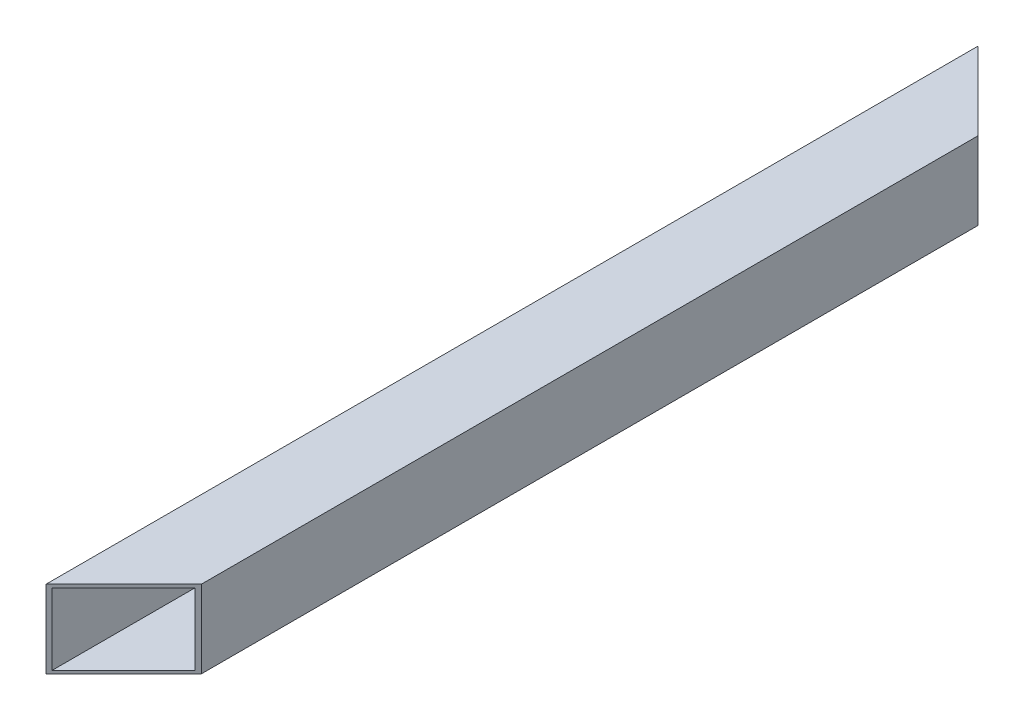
ISO-10303-21;
HEADER;
FILE_DESCRIPTION(('STEP AP214'),'2;1');
FILE_NAME('part.step','',(''),(''),'','','');
FILE_SCHEMA(('AUTOMOTIVE_DESIGN { 1 0 10303 214 1 1 1 1 }'));
ENDSEC;
DATA;
#1=APPLICATION_CONTEXT('core data for automotive mechanical design processes');
#2=APPLICATION_PROTOCOL_DEFINITION('international standard','automotive_design',2000,#1);
#3=PRODUCT_CONTEXT('',#1,'mechanical');
#4=PRODUCT('Part','Part','',(#3));
#5=PRODUCT_RELATED_PRODUCT_CATEGORY('part','',(#4));
#6=PRODUCT_DEFINITION_FORMATION('','',#4);
#7=PRODUCT_DEFINITION_CONTEXT('part definition',#1,'design');
#8=PRODUCT_DEFINITION('design','',#6,#7);
#9=PRODUCT_DEFINITION_SHAPE('','',#8);
#10=(LENGTH_UNIT() NAMED_UNIT(*) SI_UNIT(.MILLI.,.METRE.));
#11=(NAMED_UNIT(*) PLANE_ANGLE_UNIT() SI_UNIT($,.RADIAN.));
#12=(NAMED_UNIT(*) SI_UNIT($,.STERADIAN.) SOLID_ANGLE_UNIT());
#13=UNCERTAINTY_MEASURE_WITH_UNIT(LENGTH_MEASURE(1.E-05),#10,'distance_accuracy_value','');
#14=(GEOMETRIC_REPRESENTATION_CONTEXT(3) GLOBAL_UNCERTAINTY_ASSIGNED_CONTEXT((#13)) GLOBAL_UNIT_ASSIGNED_CONTEXT((#10,
#11,#12)) REPRESENTATION_CONTEXT('',''));
#15=CARTESIAN_POINT('',(0.,0.,0.));
#16=DIRECTION('',(0.,0.,1.));
#17=DIRECTION('',(1.,0.,0.));
#18=AXIS2_PLACEMENT_3D('',#15,#16,#17);
#19=CARTESIAN_POINT('',(-69.,69.,-75.));
#20=DIRECTION('',(1.,0.,0.));
#21=DIRECTION('',(0.,1.,0.));
#22=AXIS2_PLACEMENT_3D('',#19,#20,#21);
#23=PLANE('',#22);
#24=DIRECTION('',(0.,-1.,0.));
#25=VECTOR('',#24,1.);
#26=CARTESIAN_POINT('',(-69.,34.5,-69.));
#27=LINE('',#26,#25);
#28=CARTESIAN_POINT('',(-69.,69.,-69.));
#29=VERTEX_POINT('',#28);
#30=CARTESIAN_POINT('',(-69.,-69.,-69.));
#31=VERTEX_POINT('',#30);
#32=EDGE_CURVE('E241',#29,#31,#27,.T.);
#33=ORIENTED_EDGE('',*,*,#32,.F.);
#34=DIRECTION('',(0.,0.,1.));
#35=VECTOR('',#34,1.);
#36=CARTESIAN_POINT('',(-69.,69.,-75.));
#37=LINE('',#36,#35);
#38=CARTESIAN_POINT('',(-69.,69.,1719.));
#39=VERTEX_POINT('',#38);
#40=EDGE_CURVE('E10',#29,#39,#37,.T.);
#41=ORIENTED_EDGE('',*,*,#40,.T.);
#42=DIRECTION('',(0.,1.,0.));
#43=VECTOR('',#42,1.);
#44=CARTESIAN_POINT('',(-69.,34.5,1719.));
#45=LINE('',#44,#43);
#46=CARTESIAN_POINT('',(-69.,-69.,1719.));
#47=VERTEX_POINT('',#46);
#48=EDGE_CURVE('E96',#47,#39,#45,.T.);
#49=ORIENTED_EDGE('',*,*,#48,.F.);
#50=DIRECTION('',(0.,0.,1.));
#51=VECTOR('',#50,1.);
#52=CARTESIAN_POINT('',(-69.,-69.,-75.));
#53=LINE('',#52,#51);
#54=EDGE_CURVE('E77',#31,#47,#53,.T.);
#55=ORIENTED_EDGE('',*,*,#54,.F.);
#56=EDGE_LOOP('',(#33,#41,#49,#55));
#57=FACE_BOUND('',#56,.T.);
#58=ADVANCED_FACE('F16',(#57),#23,.T.);
#59=CARTESIAN_POINT('',(69.,69.,-75.));
#60=DIRECTION('',(0.,-1.,0.));
#61=DIRECTION('',(0.,0.,-1.));
#62=AXIS2_PLACEMENT_3D('',#59,#60,#61);
#63=PLANE('',#62);
#64=DIRECTION('',(-0.707106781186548,0.,-0.707106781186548));
#65=VECTOR('',#64,1.);
#66=CARTESIAN_POINT('',(-1.5,69.,-1.5));
#67=LINE('',#66,#65);
#68=CARTESIAN_POINT('',(69.,69.,69.));
#69=VERTEX_POINT('',#68);
#70=EDGE_CURVE('E244',#69,#29,#67,.T.);
#71=ORIENTED_EDGE('',*,*,#70,.F.);
#72=DIRECTION('',(0.,0.,1.));
#73=VECTOR('',#72,1.);
#74=CARTESIAN_POINT('',(69.,69.,-75.));
#75=LINE('',#74,#73);
#76=CARTESIAN_POINT('',(69.,69.,1581.));
#77=VERTEX_POINT('',#76);
#78=EDGE_CURVE('E24',#69,#77,#75,.T.);
#79=ORIENTED_EDGE('',*,*,#78,.T.);
#80=DIRECTION('',(0.707106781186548,0.,-0.707106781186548));
#81=VECTOR('',#80,1.);
#82=CARTESIAN_POINT('',(861.,69.,789.));
#83=LINE('',#82,#81);
#84=EDGE_CURVE('E101',#39,#77,#83,.T.);
#85=ORIENTED_EDGE('',*,*,#84,.F.);
#86=ORIENTED_EDGE('',*,*,#40,.F.);
#87=EDGE_LOOP('',(#71,#79,#85,#86));
#88=FACE_BOUND('',#87,.T.);
#89=ADVANCED_FACE('F179',(#88),#63,.T.);
#90=CARTESIAN_POINT('',(69.,-69.,-75.));
#91=DIRECTION('',(-1.,0.,0.));
#92=DIRECTION('',(0.,0.,1.));
#93=AXIS2_PLACEMENT_3D('',#90,#91,#92);
#94=PLANE('',#93);
#95=DIRECTION('',(0.,1.,0.));
#96=VECTOR('',#95,1.);
#97=CARTESIAN_POINT('',(69.,-34.5,69.));
#98=LINE('',#97,#96);
#99=CARTESIAN_POINT('',(69.,-69.,69.));
#100=VERTEX_POINT('',#99);
#101=EDGE_CURVE('E240',#100,#69,#98,.T.);
#102=ORIENTED_EDGE('',*,*,#101,.F.);
#103=DIRECTION('',(0.,0.,1.));
#104=VECTOR('',#103,1.);
#105=CARTESIAN_POINT('',(69.,-69.,-75.));
#106=LINE('',#105,#104);
#107=CARTESIAN_POINT('',(69.,-69.,1581.));
#108=VERTEX_POINT('',#107);
#109=EDGE_CURVE('E36',#100,#108,#106,.T.);
#110=ORIENTED_EDGE('',*,*,#109,.T.);
#111=DIRECTION('',(0.,-1.,0.));
#112=VECTOR('',#111,1.);
#113=CARTESIAN_POINT('',(69.,-34.5,1581.));
#114=LINE('',#113,#112);
#115=EDGE_CURVE('E97',#77,#108,#114,.T.);
#116=ORIENTED_EDGE('',*,*,#115,.F.);
#117=ORIENTED_EDGE('',*,*,#78,.F.);
#118=EDGE_LOOP('',(#102,#110,#116,#117));
#119=FACE_BOUND('',#118,.T.);
#120=ADVANCED_FACE('F132',(#119),#94,.T.);
#121=CARTESIAN_POINT('',(-69.,-69.,-75.));
#122=DIRECTION('',(0.,1.,0.));
#123=DIRECTION('',(1.,0.,0.));
#124=AXIS2_PLACEMENT_3D('',#121,#122,#123);
#125=PLANE('',#124);
#126=DIRECTION('',(0.707106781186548,0.,0.707106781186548));
#127=VECTOR('',#126,1.);
#128=CARTESIAN_POINT('',(-36.,-69.,-36.));
#129=LINE('',#128,#127);
#130=EDGE_CURVE('E83',#31,#100,#129,.T.);
#131=ORIENTED_EDGE('',*,*,#130,.F.);
#132=ORIENTED_EDGE('',*,*,#54,.T.);
#133=DIRECTION('',(-0.707106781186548,0.,0.707106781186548));
#134=VECTOR('',#133,1.);
#135=CARTESIAN_POINT('',(826.5,-69.,823.5));
#136=LINE('',#135,#134);
#137=EDGE_CURVE('E80',#108,#47,#136,.T.);
#138=ORIENTED_EDGE('',*,*,#137,.F.);
#139=ORIENTED_EDGE('',*,*,#109,.F.);
#140=EDGE_LOOP('',(#131,#132,#138,#139));
#141=FACE_BOUND('',#140,.T.);
#142=ADVANCED_FACE('F79',(#141),#125,.T.);
#143=CARTESIAN_POINT('',(75.,75.,-75.));
#144=DIRECTION('',(0.,-1.,0.));
#145=DIRECTION('',(0.,0.,-1.));
#146=AXIS2_PLACEMENT_3D('',#143,#144,#145);
#147=PLANE('',#146);
#148=DIRECTION('',(0.,0.,1.));
#149=VECTOR('',#148,1.);
#150=CARTESIAN_POINT('',(-75.,75.,-75.));
#151=LINE('',#150,#149);
#152=CARTESIAN_POINT('',(-75.,75.,-75.));
#153=VERTEX_POINT('',#152);
#154=CARTESIAN_POINT('',(-75.,75.,1725.));
#155=VERTEX_POINT('',#154);
#156=EDGE_CURVE('E89',#153,#155,#151,.T.);
#157=ORIENTED_EDGE('',*,*,#156,.T.);
#158=DIRECTION('',(0.707106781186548,0.,-0.707106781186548));
#159=VECTOR('',#158,1.);
#160=CARTESIAN_POINT('',(862.5,75.,787.5));
#161=LINE('',#160,#159);
#162=CARTESIAN_POINT('',(75.,75.,1575.));
#163=VERTEX_POINT('',#162);
#164=EDGE_CURVE('E110',#155,#163,#161,.T.);
#165=ORIENTED_EDGE('',*,*,#164,.T.);
#166=DIRECTION('',(0.,0.,1.));
#167=VECTOR('',#166,1.);
#168=CARTESIAN_POINT('',(75.,75.,-75.));
#169=LINE('',#168,#167);
#170=CARTESIAN_POINT('',(75.,75.,75.));
#171=VERTEX_POINT('',#170);
#172=EDGE_CURVE('E242',#171,#163,#169,.T.);
#173=ORIENTED_EDGE('',*,*,#172,.F.);
#174=DIRECTION('',(-0.707106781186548,0.,-0.707106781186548));
#175=VECTOR('',#174,1.);
#176=CARTESIAN_POINT('',(0.,75.,0.));
#177=LINE('',#176,#175);
#178=EDGE_CURVE('E245',#171,#153,#177,.T.);
#179=ORIENTED_EDGE('',*,*,#178,.T.);
#180=EDGE_LOOP('',(#157,#165,#173,#179));
#181=FACE_BOUND('',#180,.T.);
#182=ADVANCED_FACE('F131',(#181),#147,.F.);
#183=CARTESIAN_POINT('',(-75.,75.,-75.));
#184=DIRECTION('',(1.,0.,0.));
#185=DIRECTION('',(0.,1.,0.));
#186=AXIS2_PLACEMENT_3D('',#183,#184,#185);
#187=PLANE('',#186);
#188=DIRECTION('',(0.,-1.,0.));
#189=VECTOR('',#188,1.);
#190=CARTESIAN_POINT('',(-75.,75.,-75.));
#191=LINE('',#190,#189);
#192=CARTESIAN_POINT('',(-75.,-75.,-75.));
#193=VERTEX_POINT('',#192);
#194=EDGE_CURVE('E253',#153,#193,#191,.T.);
#195=ORIENTED_EDGE('',*,*,#194,.T.);
#196=DIRECTION('',(0.,0.,1.));
#197=VECTOR('',#196,1.);
#198=CARTESIAN_POINT('',(-75.,-75.,-75.));
#199=LINE('',#198,#197);
#200=CARTESIAN_POINT('',(-75.,-75.,1725.));
#201=VERTEX_POINT('',#200);
#202=EDGE_CURVE('E278',#193,#201,#199,.T.);
#203=ORIENTED_EDGE('',*,*,#202,.T.);
#204=DIRECTION('',(0.,-1.,0.));
#205=VECTOR('',#204,1.);
#206=CARTESIAN_POINT('',(-75.,75.,1725.));
#207=LINE('',#206,#205);
#208=EDGE_CURVE('E102',#155,#201,#207,.T.);
#209=ORIENTED_EDGE('',*,*,#208,.F.);
#210=ORIENTED_EDGE('',*,*,#156,.F.);
#211=EDGE_LOOP('',(#195,#203,#209,#210));
#212=FACE_BOUND('',#211,.T.);
#213=ADVANCED_FACE('F159',(#212),#187,.F.);
#214=CARTESIAN_POINT('',(825.,0.,825.));
#215=DIRECTION('',(-0.707106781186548,0.,-0.707106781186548));
#216=DIRECTION('',(-0.707106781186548,0.,0.707106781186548));
#217=AXIS2_PLACEMENT_3D('',#214,#215,#216);
#218=PLANE('',#217);
#219=ORIENTED_EDGE('',*,*,#48,.T.);
#220=ORIENTED_EDGE('',*,*,#84,.T.);
#221=ORIENTED_EDGE('',*,*,#115,.T.);
#222=ORIENTED_EDGE('',*,*,#137,.T.);
#223=EDGE_LOOP('',(#219,#220,#221,#222));
#224=FACE_BOUND('',#223,.T.);
#225=DIRECTION('',(-0.707106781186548,0.,0.707106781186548));
#226=VECTOR('',#225,1.);
#227=CARTESIAN_POINT('',(825.,-75.,825.));
#228=LINE('',#227,#226);
#229=CARTESIAN_POINT('',(75.,-75.,1575.));
#230=VERTEX_POINT('',#229);
#231=EDGE_CURVE('E275',#230,#201,#228,.T.);
#232=ORIENTED_EDGE('',*,*,#231,.F.);
#233=DIRECTION('',(0.,-1.,0.));
#234=VECTOR('',#233,1.);
#235=CARTESIAN_POINT('',(75.,-37.5,1575.));
#236=LINE('',#235,#234);
#237=EDGE_CURVE('E256',#163,#230,#236,.T.);
#238=ORIENTED_EDGE('',*,*,#237,.F.);
#239=ORIENTED_EDGE('',*,*,#164,.F.);
#240=ORIENTED_EDGE('',*,*,#208,.T.);
#241=EDGE_LOOP('',(#232,#238,#239,#240));
#242=FACE_BOUND('',#241,.T.);
#243=ADVANCED_FACE('F93',(#224,#242),#218,.F.);
#244=CARTESIAN_POINT('',(75.,-75.,-75.));
#245=DIRECTION('',(-1.,0.,0.));
#246=DIRECTION('',(0.,0.,1.));
#247=AXIS2_PLACEMENT_3D('',#244,#245,#246);
#248=PLANE('',#247);
#249=ORIENTED_EDGE('',*,*,#172,.T.);
#250=ORIENTED_EDGE('',*,*,#237,.T.);
#251=DIRECTION('',(0.,0.,1.));
#252=VECTOR('',#251,1.);
#253=CARTESIAN_POINT('',(75.,-75.,-75.));
#254=LINE('',#253,#252);
#255=CARTESIAN_POINT('',(75.,-75.,75.));
#256=VERTEX_POINT('',#255);
#257=EDGE_CURVE('E290',#256,#230,#254,.T.);
#258=ORIENTED_EDGE('',*,*,#257,.F.);
#259=DIRECTION('',(0.,1.,0.));
#260=VECTOR('',#259,1.);
#261=CARTESIAN_POINT('',(75.,-37.5,75.));
#262=LINE('',#261,#260);
#263=EDGE_CURVE('E277',#256,#171,#262,.T.);
#264=ORIENTED_EDGE('',*,*,#263,.T.);
#265=EDGE_LOOP('',(#249,#250,#258,#264));
#266=FACE_BOUND('',#265,.T.);
#267=ADVANCED_FACE('F153',(#266),#248,.F.);
#268=CARTESIAN_POINT('',(0.,0.,0.));
#269=DIRECTION('',(-0.707106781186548,0.,0.707106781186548));
#270=DIRECTION('',(0.,1.,0.));
#271=AXIS2_PLACEMENT_3D('',#268,#269,#270);
#272=PLANE('',#271);
#273=ORIENTED_EDGE('',*,*,#101,.T.);
#274=ORIENTED_EDGE('',*,*,#70,.T.);
#275=ORIENTED_EDGE('',*,*,#32,.T.);
#276=ORIENTED_EDGE('',*,*,#130,.T.);
#277=EDGE_LOOP('',(#273,#274,#275,#276));
#278=FACE_BOUND('',#277,.T.);
#279=ORIENTED_EDGE('',*,*,#263,.F.);
#280=DIRECTION('',(0.707106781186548,0.,0.707106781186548));
#281=VECTOR('',#280,1.);
#282=CARTESIAN_POINT('',(-37.5,-75.,-37.5));
#283=LINE('',#282,#281);
#284=EDGE_CURVE('E282',#193,#256,#283,.T.);
#285=ORIENTED_EDGE('',*,*,#284,.F.);
#286=ORIENTED_EDGE('',*,*,#194,.F.);
#287=ORIENTED_EDGE('',*,*,#178,.F.);
#288=EDGE_LOOP('',(#279,#285,#286,#287));
#289=FACE_BOUND('',#288,.T.);
#290=ADVANCED_FACE('F144',(#278,#289),#272,.F.);
#291=CARTESIAN_POINT('',(-75.,-75.,-75.));
#292=DIRECTION('',(0.,1.,0.));
#293=DIRECTION('',(1.,0.,0.));
#294=AXIS2_PLACEMENT_3D('',#291,#292,#293);
#295=PLANE('',#294);
#296=ORIENTED_EDGE('',*,*,#257,.T.);
#297=ORIENTED_EDGE('',*,*,#231,.T.);
#298=ORIENTED_EDGE('',*,*,#202,.F.);
#299=ORIENTED_EDGE('',*,*,#284,.T.);
#300=EDGE_LOOP('',(#296,#297,#298,#299));
#301=FACE_BOUND('',#300,.T.);
#302=ADVANCED_FACE('F139',(#301),#295,.F.);
#303=CLOSED_SHELL('',(#58,#89,#120,#142,#182,#213,#243,#267,#290,#302));
#304=MANIFOLD_SOLID_BREP('B1',#303);
#305=ADVANCED_BREP_SHAPE_REPRESENTATION('',(#18,#304),#14);
#306=SHAPE_DEFINITION_REPRESENTATION(#9,#305);
ENDSEC;
END-ISO-10303-21;
